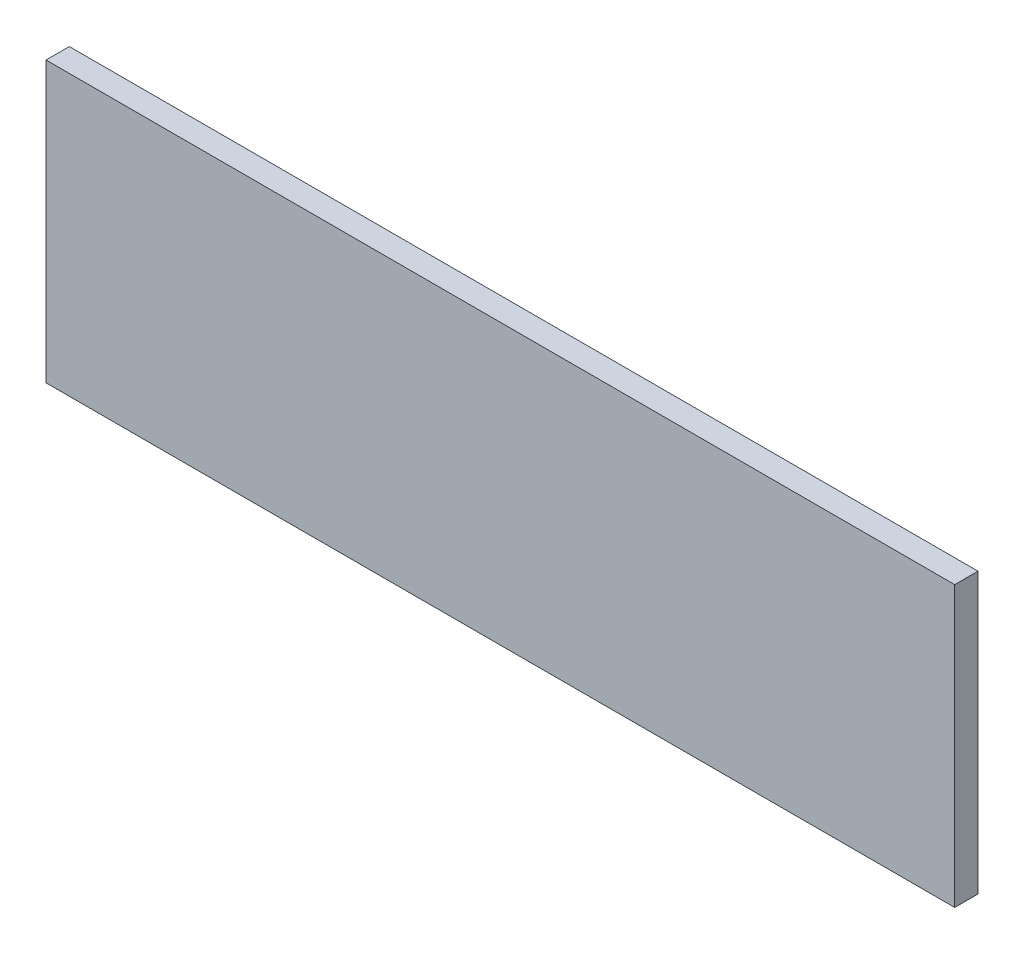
ISO-10303-21;
HEADER;
FILE_DESCRIPTION(('STEP AP214'),'2;1');
FILE_NAME('part.step','',(''),(''),'','','');
FILE_SCHEMA(('AUTOMOTIVE_DESIGN { 1 0 10303 214 1 1 1 1 }'));
ENDSEC;
DATA;
#1=APPLICATION_CONTEXT('core data for automotive mechanical design processes');
#2=APPLICATION_PROTOCOL_DEFINITION('international standard','automotive_design',2000,#1);
#3=PRODUCT_CONTEXT('',#1,'mechanical');
#4=PRODUCT('Part','Part','',(#3));
#5=PRODUCT_RELATED_PRODUCT_CATEGORY('part','',(#4));
#6=PRODUCT_DEFINITION_FORMATION('','',#4);
#7=PRODUCT_DEFINITION_CONTEXT('part definition',#1,'design');
#8=PRODUCT_DEFINITION('design','',#6,#7);
#9=PRODUCT_DEFINITION_SHAPE('','',#8);
#10=(LENGTH_UNIT() NAMED_UNIT(*) SI_UNIT(.MILLI.,.METRE.));
#11=(NAMED_UNIT(*) PLANE_ANGLE_UNIT() SI_UNIT($,.RADIAN.));
#12=(NAMED_UNIT(*) SI_UNIT($,.STERADIAN.) SOLID_ANGLE_UNIT());
#13=UNCERTAINTY_MEASURE_WITH_UNIT(LENGTH_MEASURE(1.E-05),#10,'distance_accuracy_value','');
#14=(GEOMETRIC_REPRESENTATION_CONTEXT(3) GLOBAL_UNCERTAINTY_ASSIGNED_CONTEXT((#13)) GLOBAL_UNIT_ASSIGNED_CONTEXT((#10,
#11,#12)) REPRESENTATION_CONTEXT('',''));
#15=CARTESIAN_POINT('',(0.,0.,0.));
#16=DIRECTION('',(0.,0.,1.));
#17=DIRECTION('',(1.,0.,0.));
#18=AXIS2_PLACEMENT_3D('',#15,#16,#17);
#19=CARTESIAN_POINT('',(0.,0.,6.35));
#20=DIRECTION('',(1.,0.,0.));
#21=DIRECTION('',(0.,0.,-1.));
#22=AXIS2_PLACEMENT_3D('',#19,#20,#21);
#23=PLANE('',#22);
#24=DIRECTION('',(0.,-1.,0.));
#25=VECTOR('',#24,1.);
#26=CARTESIAN_POINT('',(0.,0.,0.));
#27=LINE('',#26,#25);
#28=CARTESIAN_POINT('',(0.,76.2,0.));
#29=VERTEX_POINT('',#28);
#30=CARTESIAN_POINT('',(0.,0.,0.));
#31=VERTEX_POINT('',#30);
#32=EDGE_CURVE('E107',#29,#31,#27,.T.);
#33=ORIENTED_EDGE('',*,*,#32,.T.);
#34=DIRECTION('',(0.,0.,-1.));
#35=VECTOR('',#34,1.);
#36=CARTESIAN_POINT('',(0.,0.,6.35));
#37=LINE('',#36,#35);
#38=CARTESIAN_POINT('',(0.,0.,6.35));
#39=VERTEX_POINT('',#38);
#40=EDGE_CURVE('E11',#39,#31,#37,.T.);
#41=ORIENTED_EDGE('',*,*,#40,.F.);
#42=DIRECTION('',(0.,-1.,0.));
#43=VECTOR('',#42,1.);
#44=CARTESIAN_POINT('',(0.,0.,6.35));
#45=LINE('',#44,#43);
#46=CARTESIAN_POINT('',(0.,76.2,6.35));
#47=VERTEX_POINT('',#46);
#48=EDGE_CURVE('E91',#47,#39,#45,.T.);
#49=ORIENTED_EDGE('',*,*,#48,.F.);
#50=DIRECTION('',(0.,0.,-1.));
#51=VECTOR('',#50,1.);
#52=CARTESIAN_POINT('',(0.,76.2,6.35));
#53=LINE('',#52,#51);
#54=EDGE_CURVE('E103',#47,#29,#53,.T.);
#55=ORIENTED_EDGE('',*,*,#54,.T.);
#56=EDGE_LOOP('',(#33,#41,#49,#55));
#57=FACE_BOUND('',#56,.T.);
#58=ADVANCED_FACE('F39',(#57),#23,.F.);
#59=CARTESIAN_POINT('',(0.,0.,6.35));
#60=DIRECTION('',(0.,1.,0.));
#61=DIRECTION('',(0.,0.,1.));
#62=AXIS2_PLACEMENT_3D('',#59,#60,#61);
#63=PLANE('',#62);
#64=DIRECTION('',(1.,0.,0.));
#65=VECTOR('',#64,1.);
#66=CARTESIAN_POINT('',(0.,0.,0.));
#67=LINE('',#66,#65);
#68=CARTESIAN_POINT('',(247.65,0.,0.));
#69=VERTEX_POINT('',#68);
#70=EDGE_CURVE('E96',#31,#69,#67,.T.);
#71=ORIENTED_EDGE('',*,*,#70,.T.);
#72=DIRECTION('',(0.,0.,-1.));
#73=VECTOR('',#72,1.);
#74=CARTESIAN_POINT('',(247.65,0.,6.35));
#75=LINE('',#74,#73);
#76=CARTESIAN_POINT('',(247.65,0.,6.35));
#77=VERTEX_POINT('',#76);
#78=EDGE_CURVE('E48',#77,#69,#75,.T.);
#79=ORIENTED_EDGE('',*,*,#78,.F.);
#80=DIRECTION('',(1.,0.,0.));
#81=VECTOR('',#80,1.);
#82=CARTESIAN_POINT('',(0.,0.,6.35));
#83=LINE('',#82,#81);
#84=EDGE_CURVE('E86',#39,#77,#83,.T.);
#85=ORIENTED_EDGE('',*,*,#84,.F.);
#86=ORIENTED_EDGE('',*,*,#40,.T.);
#87=EDGE_LOOP('',(#71,#79,#85,#86));
#88=FACE_BOUND('',#87,.T.);
#89=ADVANCED_FACE('F95',(#88),#63,.F.);
#90=CARTESIAN_POINT('',(247.65,0.,6.35));
#91=DIRECTION('',(-1.,0.,0.));
#92=DIRECTION('',(0.,0.,1.));
#93=AXIS2_PLACEMENT_3D('',#90,#91,#92);
#94=PLANE('',#93);
#95=DIRECTION('',(0.,1.,0.));
#96=VECTOR('',#95,1.);
#97=CARTESIAN_POINT('',(247.65,0.,0.));
#98=LINE('',#97,#96);
#99=CARTESIAN_POINT('',(247.65,76.2,0.));
#100=VERTEX_POINT('',#99);
#101=EDGE_CURVE('E73',#69,#100,#98,.T.);
#102=ORIENTED_EDGE('',*,*,#101,.T.);
#103=DIRECTION('',(0.,0.,-1.));
#104=VECTOR('',#103,1.);
#105=CARTESIAN_POINT('',(247.65,76.2,6.35));
#106=LINE('',#105,#104);
#107=CARTESIAN_POINT('',(247.65,76.2,6.35));
#108=VERTEX_POINT('',#107);
#109=EDGE_CURVE('E98',#108,#100,#106,.T.);
#110=ORIENTED_EDGE('',*,*,#109,.F.);
#111=DIRECTION('',(0.,1.,0.));
#112=VECTOR('',#111,1.);
#113=CARTESIAN_POINT('',(247.65,0.,6.35));
#114=LINE('',#113,#112);
#115=EDGE_CURVE('E89',#77,#108,#114,.T.);
#116=ORIENTED_EDGE('',*,*,#115,.F.);
#117=ORIENTED_EDGE('',*,*,#78,.T.);
#118=EDGE_LOOP('',(#102,#110,#116,#117));
#119=FACE_BOUND('',#118,.T.);
#120=ADVANCED_FACE('F99',(#119),#94,.F.);
#121=CARTESIAN_POINT('',(0.,76.2,6.35));
#122=DIRECTION('',(0.,-1.,0.));
#123=DIRECTION('',(0.,0.,-1.));
#124=AXIS2_PLACEMENT_3D('',#121,#122,#123);
#125=PLANE('',#124);
#126=DIRECTION('',(-1.,0.,0.));
#127=VECTOR('',#126,1.);
#128=CARTESIAN_POINT('',(0.,76.2,0.));
#129=LINE('',#128,#127);
#130=EDGE_CURVE('E79',#100,#29,#129,.T.);
#131=ORIENTED_EDGE('',*,*,#130,.T.);
#132=ORIENTED_EDGE('',*,*,#54,.F.);
#133=DIRECTION('',(-1.,0.,0.));
#134=VECTOR('',#133,1.);
#135=CARTESIAN_POINT('',(0.,76.2,6.35));
#136=LINE('',#135,#134);
#137=EDGE_CURVE('E56',#108,#47,#136,.T.);
#138=ORIENTED_EDGE('',*,*,#137,.F.);
#139=ORIENTED_EDGE('',*,*,#109,.T.);
#140=EDGE_LOOP('',(#131,#132,#138,#139));
#141=FACE_BOUND('',#140,.T.);
#142=ADVANCED_FACE('F120',(#141),#125,.F.);
#143=CARTESIAN_POINT('',(0.,0.,6.35));
#144=DIRECTION('',(0.,0.,-1.));
#145=DIRECTION('',(-1.,0.,0.));
#146=AXIS2_PLACEMENT_3D('',#143,#144,#145);
#147=PLANE('',#146);
#148=ORIENTED_EDGE('',*,*,#48,.T.);
#149=ORIENTED_EDGE('',*,*,#84,.T.);
#150=ORIENTED_EDGE('',*,*,#115,.T.);
#151=ORIENTED_EDGE('',*,*,#137,.T.);
#152=EDGE_LOOP('',(#148,#149,#150,#151));
#153=FACE_BOUND('',#152,.T.);
#154=ADVANCED_FACE('F87',(#153),#147,.F.);
#155=CARTESIAN_POINT('',(0.,0.,0.));
#156=DIRECTION('',(0.,0.,-1.));
#157=DIRECTION('',(-1.,0.,0.));
#158=AXIS2_PLACEMENT_3D('',#155,#156,#157);
#159=PLANE('',#158);
#160=ORIENTED_EDGE('',*,*,#32,.F.);
#161=ORIENTED_EDGE('',*,*,#130,.F.);
#162=ORIENTED_EDGE('',*,*,#101,.F.);
#163=ORIENTED_EDGE('',*,*,#70,.F.);
#164=EDGE_LOOP('',(#160,#161,#162,#163));
#165=FACE_BOUND('',#164,.T.);
#166=ADVANCED_FACE('F123',(#165),#159,.T.);
#167=CLOSED_SHELL('',(#58,#89,#120,#142,#154,#166));
#168=MANIFOLD_SOLID_BREP('B2',#167);
#169=ADVANCED_BREP_SHAPE_REPRESENTATION('',(#18,#168),#14);
#170=SHAPE_DEFINITION_REPRESENTATION(#9,#169);
ENDSEC;
END-ISO-10303-21;
